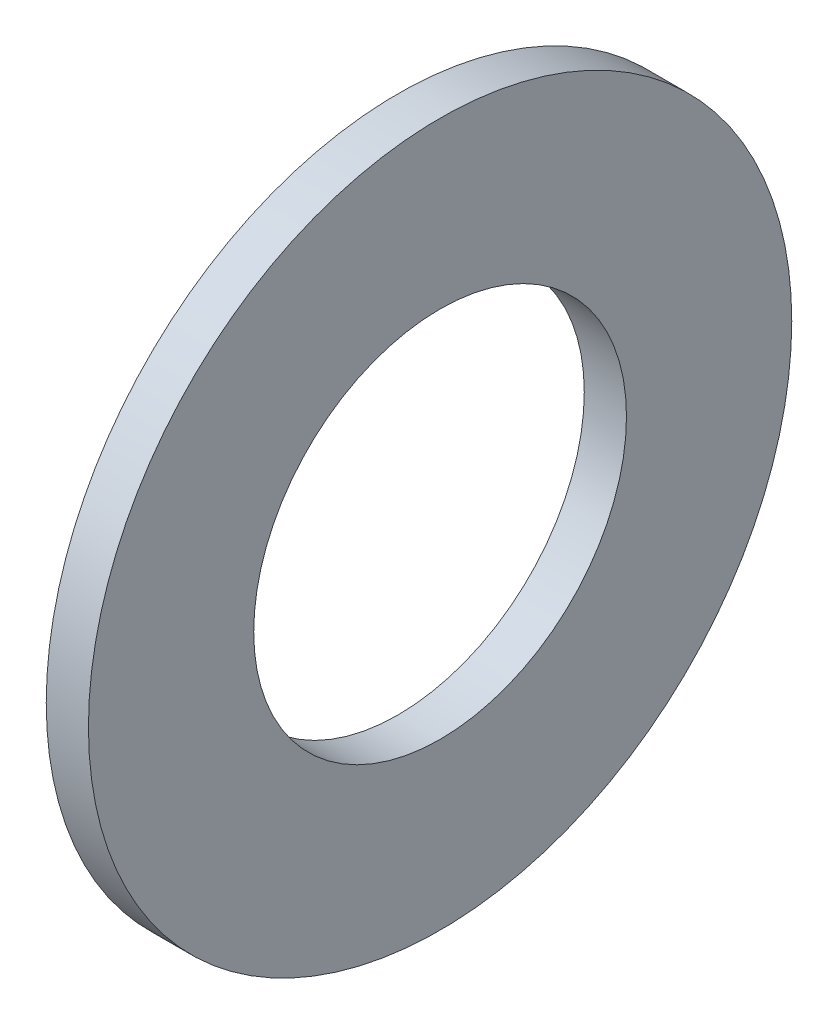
ISO-10303-21;
HEADER;
FILE_DESCRIPTION(('STEP AP214'),'2;1');
FILE_NAME('part.step','',(''),(''),'','','');
FILE_SCHEMA(('AUTOMOTIVE_DESIGN { 1 0 10303 214 1 1 1 1 }'));
ENDSEC;
DATA;
#1=APPLICATION_CONTEXT('core data for automotive mechanical design processes');
#2=APPLICATION_PROTOCOL_DEFINITION('international standard','automotive_design',2000,#1);
#3=PRODUCT_CONTEXT('',#1,'mechanical');
#4=PRODUCT('Part','Part','',(#3));
#5=PRODUCT_RELATED_PRODUCT_CATEGORY('part','',(#4));
#6=PRODUCT_DEFINITION_FORMATION('','',#4);
#7=PRODUCT_DEFINITION_CONTEXT('part definition',#1,'design');
#8=PRODUCT_DEFINITION('design','',#6,#7);
#9=PRODUCT_DEFINITION_SHAPE('','',#8);
#10=(LENGTH_UNIT() NAMED_UNIT(*) SI_UNIT(.MILLI.,.METRE.));
#11=(NAMED_UNIT(*) PLANE_ANGLE_UNIT() SI_UNIT($,.RADIAN.));
#12=(NAMED_UNIT(*) SI_UNIT($,.STERADIAN.) SOLID_ANGLE_UNIT());
#13=UNCERTAINTY_MEASURE_WITH_UNIT(LENGTH_MEASURE(1.E-05),#10,'distance_accuracy_value','');
#14=(GEOMETRIC_REPRESENTATION_CONTEXT(3) GLOBAL_UNCERTAINTY_ASSIGNED_CONTEXT((#13)) GLOBAL_UNIT_ASSIGNED_CONTEXT((#10,
#11,#12)) REPRESENTATION_CONTEXT('',''));
#15=CARTESIAN_POINT('',(0.,0.,0.));
#16=DIRECTION('',(0.,0.,1.));
#17=DIRECTION('',(1.,0.,0.));
#18=AXIS2_PLACEMENT_3D('',#15,#16,#17);
#19=CARTESIAN_POINT('',(0.,0.,-5.));
#20=DIRECTION('',(1.,0.,0.));
#21=DIRECTION('',(0.,0.,-1.));
#22=AXIS2_PLACEMENT_3D('',#19,#20,#21);
#23=PLANE('',#22);
#24=CARTESIAN_POINT('',(0.,0.,0.));
#25=DIRECTION('',(-1.,0.,0.));
#26=DIRECTION('',(0.,0.,1.));
#27=AXIS2_PLACEMENT_3D('',#24,#25,#26);
#28=CIRCLE('',#27,2.65);
#29=CARTESIAN_POINT('',(0.,0.,2.65));
#30=VERTEX_POINT('',#29);
#31=EDGE_CURVE('E10',#30,#30,#28,.T.);
#32=ORIENTED_EDGE('',*,*,#31,.F.);
#33=EDGE_LOOP('',(#32));
#34=FACE_BOUND('',#33,.T.);
#35=CARTESIAN_POINT('',(0.,0.,0.));
#36=DIRECTION('',(-1.,0.,0.));
#37=DIRECTION('',(0.,0.,1.));
#38=AXIS2_PLACEMENT_3D('',#35,#36,#37);
#39=CIRCLE('',#38,5.);
#40=CARTESIAN_POINT('',(0.,0.,5.));
#41=VERTEX_POINT('',#40);
#42=EDGE_CURVE('E43',#41,#41,#39,.T.);
#43=ORIENTED_EDGE('',*,*,#42,.T.);
#44=EDGE_LOOP('',(#43));
#45=FACE_BOUND('',#44,.T.);
#46=ADVANCED_FACE('F29',(#34,#45),#23,.F.);
#47=CARTESIAN_POINT('',(0.,0.,0.));
#48=DIRECTION('',(-1.,0.,0.));
#49=DIRECTION('',(0.,0.,1.));
#50=AXIS2_PLACEMENT_3D('',#47,#48,#49);
#51=CYLINDRICAL_SURFACE('',#50,2.65);
#52=CARTESIAN_POINT('',(0.6,0.,0.));
#53=DIRECTION('',(-1.,0.,0.));
#54=DIRECTION('',(0.,0.,1.));
#55=AXIS2_PLACEMENT_3D('',#52,#53,#54);
#56=CIRCLE('',#55,2.65);
#57=CARTESIAN_POINT('',(0.6,0.,2.65));
#58=VERTEX_POINT('',#57);
#59=EDGE_CURVE('E35',#58,#58,#56,.T.);
#60=ORIENTED_EDGE('',*,*,#59,.F.);
#61=EDGE_LOOP('',(#60));
#62=FACE_BOUND('',#61,.T.);
#63=ORIENTED_EDGE('',*,*,#31,.T.);
#64=EDGE_LOOP('',(#63));
#65=FACE_BOUND('',#64,.T.);
#66=ADVANCED_FACE('F58',(#62,#65),#51,.F.);
#67=CARTESIAN_POINT('',(0.6,0.,-5.));
#68=DIRECTION('',(-1.,0.,0.));
#69=DIRECTION('',(0.,0.,1.));
#70=AXIS2_PLACEMENT_3D('',#67,#68,#69);
#71=PLANE('',#70);
#72=CARTESIAN_POINT('',(0.6,0.,0.));
#73=DIRECTION('',(-1.,0.,0.));
#74=DIRECTION('',(0.,0.,1.));
#75=AXIS2_PLACEMENT_3D('',#72,#73,#74);
#76=CIRCLE('',#75,5.);
#77=CARTESIAN_POINT('',(0.6,0.,5.));
#78=VERTEX_POINT('',#77);
#79=EDGE_CURVE('E39',#78,#78,#76,.T.);
#80=ORIENTED_EDGE('',*,*,#79,.F.);
#81=EDGE_LOOP('',(#80));
#82=FACE_BOUND('',#81,.T.);
#83=ORIENTED_EDGE('',*,*,#59,.T.);
#84=EDGE_LOOP('',(#83));
#85=FACE_BOUND('',#84,.T.);
#86=ADVANCED_FACE('F53',(#82,#85),#71,.F.);
#87=CARTESIAN_POINT('',(0.,0.,0.));
#88=DIRECTION('',(-1.,0.,0.));
#89=DIRECTION('',(0.,0.,1.));
#90=AXIS2_PLACEMENT_3D('',#87,#88,#89);
#91=CYLINDRICAL_SURFACE('',#90,5.);
#92=ORIENTED_EDGE('',*,*,#42,.F.);
#93=EDGE_LOOP('',(#92));
#94=FACE_BOUND('',#93,.T.);
#95=ORIENTED_EDGE('',*,*,#79,.T.);
#96=EDGE_LOOP('',(#95));
#97=FACE_BOUND('',#96,.T.);
#98=ADVANCED_FACE('F50',(#94,#97),#91,.T.);
#99=CLOSED_SHELL('',(#46,#66,#86,#98));
#100=MANIFOLD_SOLID_BREP('B2',#99);
#101=ADVANCED_BREP_SHAPE_REPRESENTATION('',(#18,#100),#14);
#102=SHAPE_DEFINITION_REPRESENTATION(#9,#101);
ENDSEC;
END-ISO-10303-21;
